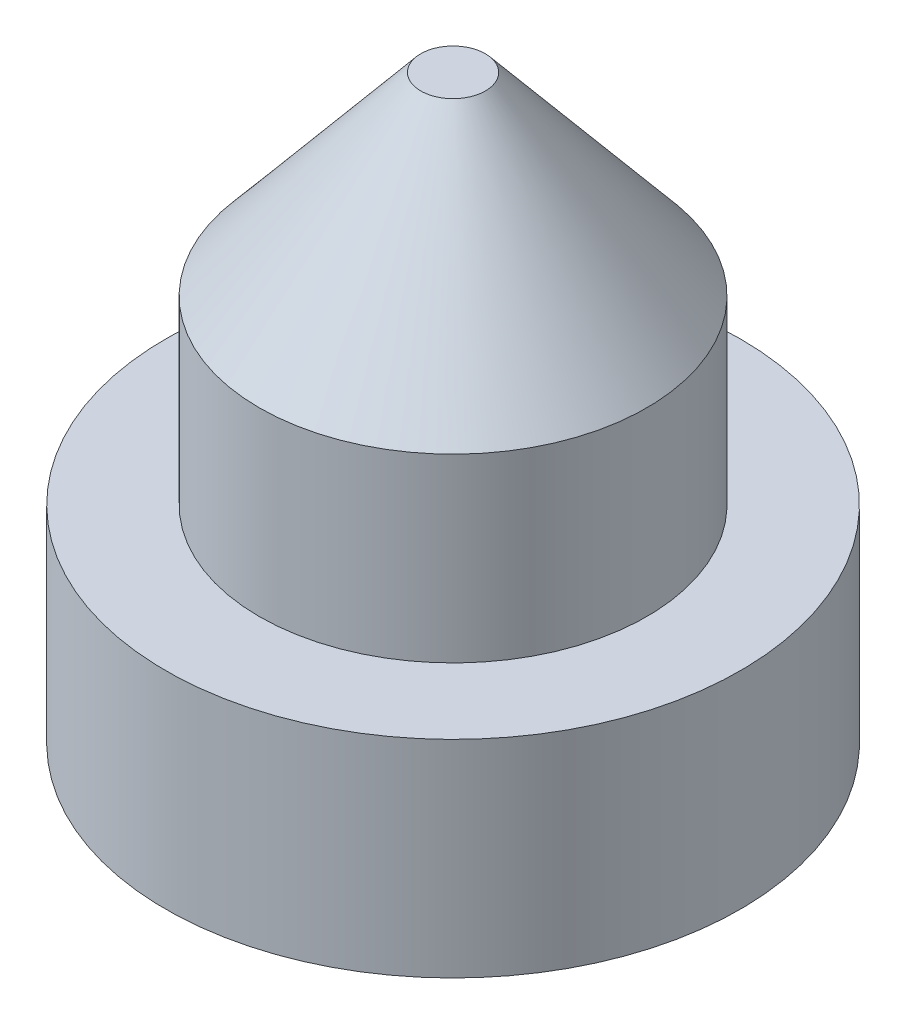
ISO-10303-21;
HEADER;
FILE_DESCRIPTION(('STEP AP214'),'2;1');
FILE_NAME('part.step','',(''),(''),'','','');
FILE_SCHEMA(('AUTOMOTIVE_DESIGN { 1 0 10303 214 1 1 1 1 }'));
ENDSEC;
DATA;
#1=APPLICATION_CONTEXT('core data for automotive mechanical design processes');
#2=APPLICATION_PROTOCOL_DEFINITION('international standard','automotive_design',2000,#1);
#3=PRODUCT_CONTEXT('',#1,'mechanical');
#4=PRODUCT('Part','Part','',(#3));
#5=PRODUCT_RELATED_PRODUCT_CATEGORY('part','',(#4));
#6=PRODUCT_DEFINITION_FORMATION('','',#4);
#7=PRODUCT_DEFINITION_CONTEXT('part definition',#1,'design');
#8=PRODUCT_DEFINITION('design','',#6,#7);
#9=PRODUCT_DEFINITION_SHAPE('','',#8);
#10=(LENGTH_UNIT() NAMED_UNIT(*) SI_UNIT(.MILLI.,.METRE.));
#11=(NAMED_UNIT(*) PLANE_ANGLE_UNIT() SI_UNIT($,.RADIAN.));
#12=(NAMED_UNIT(*) SI_UNIT($,.STERADIAN.) SOLID_ANGLE_UNIT());
#13=UNCERTAINTY_MEASURE_WITH_UNIT(LENGTH_MEASURE(1.E-05),#10,'distance_accuracy_value','');
#14=(GEOMETRIC_REPRESENTATION_CONTEXT(3) GLOBAL_UNCERTAINTY_ASSIGNED_CONTEXT((#13)) GLOBAL_UNIT_ASSIGNED_CONTEXT((#10,
#11,#12)) REPRESENTATION_CONTEXT('',''));
#15=CARTESIAN_POINT('',(0.,0.,0.));
#16=DIRECTION('',(0.,0.,1.));
#17=DIRECTION('',(1.,0.,0.));
#18=AXIS2_PLACEMENT_3D('',#15,#16,#17);
#19=CARTESIAN_POINT('',(0.,4.5,0.));
#20=DIRECTION('',(0.,1.,0.));
#21=DIRECTION('',(0.,0.,1.));
#22=AXIS2_PLACEMENT_3D('',#19,#20,#21);
#23=PLANE('',#22);
#24=CARTESIAN_POINT('',(0.,4.5,0.));
#25=DIRECTION('',(0.,-1.,0.));
#26=DIRECTION('',(0.,0.,-1.));
#27=AXIS2_PLACEMENT_3D('',#24,#25,#26);
#28=CIRCLE('',#27,0.25);
#29=CARTESIAN_POINT('',(0.,4.5,-0.249999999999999));
#30=VERTEX_POINT('',#29);
#31=EDGE_CURVE('E10',#30,#30,#28,.T.);
#32=ORIENTED_EDGE('',*,*,#31,.F.);
#33=EDGE_LOOP('',(#32));
#34=FACE_BOUND('',#33,.T.);
#35=ADVANCED_FACE('F29',(#34),#23,.T.);
#36=CARTESIAN_POINT('',(0.,3.,0.));
#37=DIRECTION('',(0.,-1.,0.));
#38=DIRECTION('',(0.,0.,-1.));
#39=AXIS2_PLACEMENT_3D('',#36,#37,#38);
#40=CONICAL_SURFACE('',#39,1.5,0.694738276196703);
#41=CARTESIAN_POINT('',(0.,3.,0.));
#42=DIRECTION('',(0.,-1.,0.));
#43=DIRECTION('',(0.,0.,-1.));
#44=AXIS2_PLACEMENT_3D('',#41,#42,#43);
#45=CIRCLE('',#44,1.5);
#46=CARTESIAN_POINT('',(0.,3.,-1.5));
#47=VERTEX_POINT('',#46);
#48=EDGE_CURVE('E35',#47,#47,#45,.T.);
#49=CARTESIAN_POINT('',(0.,4.5,-0.249999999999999));
#50=CARTESIAN_POINT('',(0.,4.484375,-0.263020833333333));
#51=CARTESIAN_POINT('',(0.,4.46875,-0.276041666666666));
#52=CARTESIAN_POINT('',(0.,4.4375,-0.302083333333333));
#53=CARTESIAN_POINT('',(0.,4.421875,-0.315104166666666));
#54=CARTESIAN_POINT('',(0.,4.390625,-0.341145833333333));
#55=CARTESIAN_POINT('',(0.,4.375,-0.354166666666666));
#56=CARTESIAN_POINT('',(0.,4.34375,-0.380208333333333));
#57=CARTESIAN_POINT('',(0.,4.328125,-0.393229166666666));
#58=CARTESIAN_POINT('',(0.,4.296875,-0.419270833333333));
#59=CARTESIAN_POINT('',(0.,4.28125,-0.432291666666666));
#60=CARTESIAN_POINT('',(0.,4.25,-0.458333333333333));
#61=CARTESIAN_POINT('',(0.,4.234375,-0.471354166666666));
#62=CARTESIAN_POINT('',(0.,4.203125,-0.497395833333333));
#63=CARTESIAN_POINT('',(0.,4.1875,-0.510416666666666));
#64=CARTESIAN_POINT('',(0.,4.15625,-0.536458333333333));
#65=CARTESIAN_POINT('',(0.,4.140625,-0.549479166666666));
#66=CARTESIAN_POINT('',(0.,4.109375,-0.575520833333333));
#67=CARTESIAN_POINT('',(0.,4.09375,-0.588541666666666));
#68=CARTESIAN_POINT('',(0.,4.0625,-0.614583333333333));
#69=CARTESIAN_POINT('',(0.,4.046875,-0.627604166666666));
#70=CARTESIAN_POINT('',(0.,4.015625,-0.653645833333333));
#71=CARTESIAN_POINT('',(0.,4.,-0.666666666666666));
#72=CARTESIAN_POINT('',(0.,3.96875,-0.692708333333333));
#73=CARTESIAN_POINT('',(0.,3.953125,-0.705729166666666));
#74=CARTESIAN_POINT('',(0.,3.921875,-0.731770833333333));
#75=CARTESIAN_POINT('',(0.,3.90625,-0.744791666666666));
#76=CARTESIAN_POINT('',(0.,3.875,-0.770833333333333));
#77=CARTESIAN_POINT('',(0.,3.859375,-0.783854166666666));
#78=CARTESIAN_POINT('',(0.,3.828125,-0.809895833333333));
#79=CARTESIAN_POINT('',(0.,3.8125,-0.822916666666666));
#80=CARTESIAN_POINT('',(0.,3.78125,-0.848958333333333));
#81=CARTESIAN_POINT('',(0.,3.765625,-0.861979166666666));
#82=CARTESIAN_POINT('',(0.,3.734375,-0.888020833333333));
#83=CARTESIAN_POINT('',(0.,3.71875,-0.901041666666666));
#84=CARTESIAN_POINT('',(0.,3.6875,-0.927083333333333));
#85=CARTESIAN_POINT('',(0.,3.671875,-0.940104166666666));
#86=CARTESIAN_POINT('',(0.,3.640625,-0.966145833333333));
#87=CARTESIAN_POINT('',(0.,3.625,-0.979166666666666));
#88=CARTESIAN_POINT('',(0.,3.59375,-1.00520833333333));
#89=CARTESIAN_POINT('',(0.,3.578125,-1.01822916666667));
#90=CARTESIAN_POINT('',(0.,3.546875,-1.04427083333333));
#91=CARTESIAN_POINT('',(0.,3.53125,-1.05729166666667));
#92=CARTESIAN_POINT('',(0.,3.5,-1.08333333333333));
#93=CARTESIAN_POINT('',(0.,3.484375,-1.09635416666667));
#94=CARTESIAN_POINT('',(0.,3.453125,-1.12239583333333));
#95=CARTESIAN_POINT('',(0.,3.4375,-1.13541666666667));
#96=CARTESIAN_POINT('',(0.,3.40625,-1.16145833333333));
#97=CARTESIAN_POINT('',(0.,3.390625,-1.17447916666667));
#98=CARTESIAN_POINT('',(0.,3.359375,-1.20052083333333));
#99=CARTESIAN_POINT('',(0.,3.34375,-1.21354166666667));
#100=CARTESIAN_POINT('',(0.,3.3125,-1.23958333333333));
#101=CARTESIAN_POINT('',(0.,3.296875,-1.25260416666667));
#102=CARTESIAN_POINT('',(0.,3.265625,-1.27864583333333));
#103=CARTESIAN_POINT('',(0.,3.25,-1.29166666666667));
#104=CARTESIAN_POINT('',(0.,3.21875,-1.31770833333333));
#105=CARTESIAN_POINT('',(0.,3.203125,-1.33072916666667));
#106=CARTESIAN_POINT('',(0.,3.171875,-1.35677083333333));
#107=CARTESIAN_POINT('',(0.,3.15625,-1.36979166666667));
#108=CARTESIAN_POINT('',(0.,3.125,-1.39583333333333));
#109=CARTESIAN_POINT('',(0.,3.109375,-1.40885416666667));
#110=CARTESIAN_POINT('',(0.,3.078125,-1.43489583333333));
#111=CARTESIAN_POINT('',(0.,3.0625,-1.44791666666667));
#112=CARTESIAN_POINT('',(0.,3.03125,-1.47395833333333));
#113=CARTESIAN_POINT('',(0.,3.015625,-1.48697916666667));
#114=CARTESIAN_POINT('',(0.,3.,-1.5));
#115=B_SPLINE_CURVE_WITH_KNOTS('',3,(#49,#50,#51,#52,#53,#54,#55,#56,#57,#58,#59,#60,#61,#62,
#63,#64,#65,#66,#67,#68,#69,#70,#71,#72,#73,#74,#75,#76,#77,#78,#79,#80,#81,#82,#83,#84,#85,#86,
#87,#88,#89,#90,#91,#92,#93,#94,#95,#96,#97,#98,#99,#100,#101,#102,#103,#104,#105,#106,#107,
#108,#109,#110,#111,#112,#113,#114),.UNSPECIFIED.,.F.,.F.,(4,2,2,2,2,2,2,2,2,2,2,2,2,2,2,2,2,2,
2,2,2,2,2,2,2,2,2,2,2,2,2,2,4),(0.,0.0610175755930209,0.122035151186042,0.183052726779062,
0.244070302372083,0.305087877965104,0.366105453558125,0.427123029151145,0.488140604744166,
0.549158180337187,0.610175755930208,0.671193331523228,0.732210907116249,0.79322848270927,
0.854246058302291,0.915263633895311,0.976281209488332,1.03729878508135,1.09831636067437,
1.15933393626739,1.22035151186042,1.28136908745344,1.34238666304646,1.40340423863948,
1.4644218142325,1.52543938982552,1.58645696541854,1.64747454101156,1.70849211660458,
1.7695096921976,1.83052726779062,1.89154484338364,1.95256241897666),.UNSPECIFIED.);
#116=EDGE_CURVE('BSEAM68',#30,#47,#115,.T.);
#117=ORIENTED_EDGE('',*,*,#31,.T.);
#118=ORIENTED_EDGE('',*,*,#48,.F.);
#119=ORIENTED_EDGE('',*,*,#116,.T.);
#120=ORIENTED_EDGE('',*,*,#116,.F.);
#121=EDGE_LOOP('',(#117,#119,#118,#120));
#122=FACE_BOUND('',#121,.T.);
#123=ADVANCED_FACE('F68',(#122),#40,.T.);
#124=CARTESIAN_POINT('',(0.,0.,0.));
#125=DIRECTION('',(0.,-1.,0.));
#126=DIRECTION('',(0.,0.,-1.));
#127=AXIS2_PLACEMENT_3D('',#124,#125,#126);
#128=CYLINDRICAL_SURFACE('',#127,1.5);
#129=ORIENTED_EDGE('',*,*,#48,.T.);
#130=EDGE_LOOP('',(#129));
#131=FACE_BOUND('',#130,.T.);
#132=CARTESIAN_POINT('',(0.,1.6,0.));
#133=DIRECTION('',(0.,-1.,0.));
#134=DIRECTION('',(0.,0.,-1.));
#135=AXIS2_PLACEMENT_3D('',#132,#133,#134);
#136=CIRCLE('',#135,1.5);
#137=CARTESIAN_POINT('',(0.,1.6,-1.5));
#138=VERTEX_POINT('',#137);
#139=EDGE_CURVE('E39',#138,#138,#136,.T.);
#140=ORIENTED_EDGE('',*,*,#139,.F.);
#141=EDGE_LOOP('',(#140));
#142=FACE_BOUND('',#141,.T.);
#143=ADVANCED_FACE('F64',(#131,#142),#128,.T.);
#144=CARTESIAN_POINT('',(2.225,1.6,0.));
#145=DIRECTION('',(0.,1.,0.));
#146=DIRECTION('',(0.,0.,1.));
#147=AXIS2_PLACEMENT_3D('',#144,#145,#146);
#148=PLANE('',#147);
#149=ORIENTED_EDGE('',*,*,#139,.T.);
#150=EDGE_LOOP('',(#149));
#151=FACE_BOUND('',#150,.T.);
#152=CARTESIAN_POINT('',(0.,1.6,0.));
#153=DIRECTION('',(0.,-1.,0.));
#154=DIRECTION('',(0.,0.,-1.));
#155=AXIS2_PLACEMENT_3D('',#152,#153,#154);
#156=CIRCLE('',#155,2.225);
#157=CARTESIAN_POINT('',(0.,1.6,-2.225));
#158=VERTEX_POINT('',#157);
#159=EDGE_CURVE('E43',#158,#158,#156,.T.);
#160=ORIENTED_EDGE('',*,*,#159,.F.);
#161=EDGE_LOOP('',(#160));
#162=FACE_BOUND('',#161,.T.);
#163=ADVANCED_FACE('F56',(#151,#162),#148,.T.);
#164=CARTESIAN_POINT('',(0.,0.,0.));
#165=DIRECTION('',(0.,-1.,0.));
#166=DIRECTION('',(0.,0.,-1.));
#167=AXIS2_PLACEMENT_3D('',#164,#165,#166);
#168=CYLINDRICAL_SURFACE('',#167,2.225);
#169=ORIENTED_EDGE('',*,*,#159,.T.);
#170=EDGE_LOOP('',(#169));
#171=FACE_BOUND('',#170,.T.);
#172=CARTESIAN_POINT('',(0.,0.,0.));
#173=DIRECTION('',(0.,-1.,0.));
#174=DIRECTION('',(0.,0.,-1.));
#175=AXIS2_PLACEMENT_3D('',#172,#173,#174);
#176=CIRCLE('',#175,2.225);
#177=CARTESIAN_POINT('',(0.,0.,-2.225));
#178=VERTEX_POINT('',#177);
#179=EDGE_CURVE('E48',#178,#178,#176,.T.);
#180=ORIENTED_EDGE('',*,*,#179,.F.);
#181=EDGE_LOOP('',(#180));
#182=FACE_BOUND('',#181,.T.);
#183=ADVANCED_FACE('F54',(#171,#182),#168,.T.);
#184=CARTESIAN_POINT('',(2.225,0.,0.));
#185=DIRECTION('',(0.,-1.,0.));
#186=DIRECTION('',(0.,0.,-1.));
#187=AXIS2_PLACEMENT_3D('',#184,#185,#186);
#188=PLANE('',#187);
#189=ORIENTED_EDGE('',*,*,#179,.T.);
#190=EDGE_LOOP('',(#189));
#191=FACE_BOUND('',#190,.T.);
#192=ADVANCED_FACE('F52',(#191),#188,.T.);
#193=CLOSED_SHELL('',(#35,#123,#143,#163,#183,#192));
#194=MANIFOLD_SOLID_BREP('B2',#193);
#195=ADVANCED_BREP_SHAPE_REPRESENTATION('',(#18,#194),#14);
#196=SHAPE_DEFINITION_REPRESENTATION(#9,#195);
ENDSEC;
END-ISO-10303-21;
